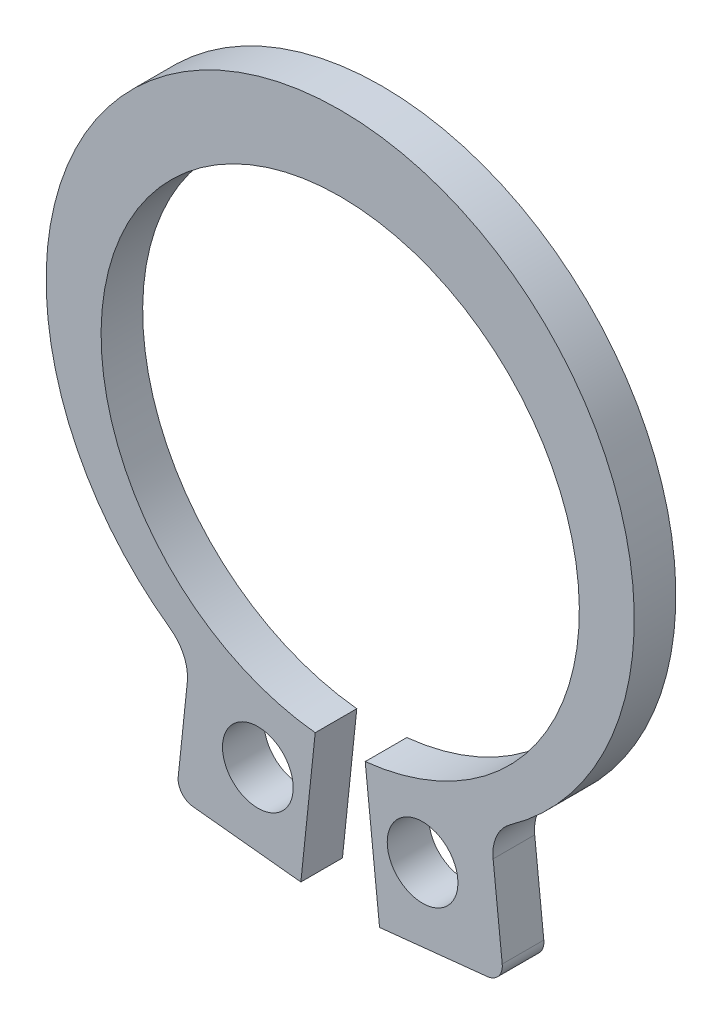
ISO-10303-21;
HEADER;
FILE_DESCRIPTION(('STEP AP214'),'2;1');
FILE_NAME('part.step','',(''),(''),'','','');
FILE_SCHEMA(('AUTOMOTIVE_DESIGN { 1 0 10303 214 1 1 1 1 }'));
ENDSEC;
DATA;
#1=APPLICATION_CONTEXT('core data for automotive mechanical design processes');
#2=APPLICATION_PROTOCOL_DEFINITION('international standard','automotive_design',2000,#1);
#3=PRODUCT_CONTEXT('',#1,'mechanical');
#4=PRODUCT('Part','Part','',(#3));
#5=PRODUCT_RELATED_PRODUCT_CATEGORY('part','',(#4));
#6=PRODUCT_DEFINITION_FORMATION('','',#4);
#7=PRODUCT_DEFINITION_CONTEXT('part definition',#1,'design');
#8=PRODUCT_DEFINITION('design','',#6,#7);
#9=PRODUCT_DEFINITION_SHAPE('','',#8);
#10=(LENGTH_UNIT() NAMED_UNIT(*) SI_UNIT(.MILLI.,.METRE.));
#11=(NAMED_UNIT(*) PLANE_ANGLE_UNIT() SI_UNIT($,.RADIAN.));
#12=(NAMED_UNIT(*) SI_UNIT($,.STERADIAN.) SOLID_ANGLE_UNIT());
#13=UNCERTAINTY_MEASURE_WITH_UNIT(LENGTH_MEASURE(1.E-05),#10,'distance_accuracy_value','');
#14=(GEOMETRIC_REPRESENTATION_CONTEXT(3) GLOBAL_UNCERTAINTY_ASSIGNED_CONTEXT((#13)) GLOBAL_UNIT_ASSIGNED_CONTEXT((#10,
#11,#12)) REPRESENTATION_CONTEXT('',''));
#15=CARTESIAN_POINT('',(0.,0.,0.));
#16=DIRECTION('',(0.,0.,1.));
#17=DIRECTION('',(1.,0.,0.));
#18=AXIS2_PLACEMENT_3D('',#15,#16,#17);
#19=CARTESIAN_POINT('',(0.,0.,1.));
#20=DIRECTION('',(0.,0.,1.));
#21=DIRECTION('',(1.,0.,0.));
#22=AXIS2_PLACEMENT_3D('',#19,#20,#21);
#23=PLANE('',#22);
#24=CARTESIAN_POINT('',(1.98041329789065,-7.13007455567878,1.));
#25=DIRECTION('',(0.,0.,1.));
#26=DIRECTION('',(-1.,0.,0.));
#27=AXIS2_PLACEMENT_3D('',#24,#25,#26);
#28=CIRCLE('',#27,0.85);
#29=CARTESIAN_POINT('',(1.13041329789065,-7.13007455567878,1.));
#30=VERTEX_POINT('',#29);
#31=EDGE_CURVE('E137',#30,#30,#28,.T.);
#32=ORIENTED_EDGE('',*,*,#31,.F.);
#33=EDGE_LOOP('',(#32));
#34=FACE_BOUND('',#33,.T.);
#35=CARTESIAN_POINT('',(0.,0.,1.));
#36=DIRECTION('',(0.,0.,-1.));
#37=DIRECTION('',(1.,0.,0.));
#38=AXIS2_PLACEMENT_3D('',#35,#36,#37);
#39=CIRCLE('',#38,5.75);
#40=CARTESIAN_POINT('',(-0.601038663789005,-5.71850089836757,1.));
#41=VERTEX_POINT('',#40);
#42=CARTESIAN_POINT('',(0.601038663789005,-5.71850089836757,1.));
#43=VERTEX_POINT('',#42);
#44=EDGE_CURVE('E163',#41,#43,#39,.T.);
#45=ORIENTED_EDGE('',*,*,#44,.T.);
#46=DIRECTION('',(0.104528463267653,-0.994521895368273,0.));
#47=VECTOR('',#46,1.);
#48=CARTESIAN_POINT('',(0.94598259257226,-9.00042315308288,1.));
#49=LINE('',#48,#47);
#50=CARTESIAN_POINT('',(0.94598259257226,-9.00042315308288,1.));
#51=VERTEX_POINT('',#50);
#52=EDGE_CURVE('E132',#43,#51,#49,.T.);
#53=ORIENTED_EDGE('',*,*,#52,.T.);
#54=DIRECTION('',(0.994521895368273,0.104528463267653,0.));
#55=VECTOR('',#54,1.);
#56=CARTESIAN_POINT('',(3.53965366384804,-8.72781733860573,1.));
#57=LINE('',#56,#55);
#58=CARTESIAN_POINT('',(3.53965366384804,-8.72781733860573,1.));
#59=VERTEX_POINT('',#58);
#60=EDGE_CURVE('E166',#51,#59,#57,.T.);
#61=ORIENTED_EDGE('',*,*,#60,.T.);
#62=CARTESIAN_POINT('',(3.49784227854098,-8.33000858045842,1.));
#63=DIRECTION('',(0.,0.,1.));
#64=DIRECTION('',(-1.,0.,0.));
#65=AXIS2_PLACEMENT_3D('',#62,#63,#64);
#66=CIRCLE('',#65,0.400000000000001);
#67=CARTESIAN_POINT('',(3.89565103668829,-8.28819719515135,1.));
#68=VERTEX_POINT('',#67);
#69=EDGE_CURVE('E168',#59,#68,#66,.T.);
#70=ORIENTED_EDGE('',*,*,#69,.T.);
#71=DIRECTION('',(-0.104528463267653,0.994521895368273,0.));
#72=VECTOR('',#71,1.);
#73=CARTESIAN_POINT('',(3.6769137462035,-6.20705089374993,1.));
#74=LINE('',#73,#72);
#75=CARTESIAN_POINT('',(3.6769137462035,-6.20705089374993,1.));
#76=VERTEX_POINT('',#75);
#77=EDGE_CURVE('E170',#68,#76,#74,.T.);
#78=ORIENTED_EDGE('',*,*,#77,.T.);
#79=CARTESIAN_POINT('',(4.67143564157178,-6.10252243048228,1.));
#80=DIRECTION('',(0.,0.,-1.));
#81=DIRECTION('',(1.,0.,0.));
#82=AXIS2_PLACEMENT_3D('',#79,#80,#81);
#83=CIRCLE('',#82,1.);
#84=CARTESIAN_POINT('',(4.09263736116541,-5.2870516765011,1.));
#85=VERTEX_POINT('',#84);
#86=EDGE_CURVE('E172',#76,#85,#83,.T.);
#87=ORIENTED_EDGE('',*,*,#86,.T.);
#88=CARTESIAN_POINT('',(0.,0.479078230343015,1.));
#89=DIRECTION('',(0.,0.,1.));
#90=DIRECTION('',(-1.,0.,0.));
#91=AXIS2_PLACEMENT_3D('',#88,#89,#90);
#92=CIRCLE('',#91,7.07092176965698);
#93=CARTESIAN_POINT('',(-4.0926373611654,-5.2870516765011,1.));
#94=VERTEX_POINT('',#93);
#95=EDGE_CURVE('E174',#85,#94,#92,.T.);
#96=ORIENTED_EDGE('',*,*,#95,.T.);
#97=CARTESIAN_POINT('',(-4.67143564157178,-6.10252243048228,1.));
#98=DIRECTION('',(0.,0.,-1.));
#99=DIRECTION('',(1.,0.,0.));
#100=AXIS2_PLACEMENT_3D('',#97,#98,#99);
#101=CIRCLE('',#100,1.);
#102=CARTESIAN_POINT('',(-3.6769137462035,-6.20705089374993,1.));
#103=VERTEX_POINT('',#102);
#104=EDGE_CURVE('E176',#94,#103,#101,.T.);
#105=ORIENTED_EDGE('',*,*,#104,.T.);
#106=DIRECTION('',(-0.104528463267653,-0.994521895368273,0.));
#107=VECTOR('',#106,1.);
#108=CARTESIAN_POINT('',(-3.89565103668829,-8.28819719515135,1.));
#109=LINE('',#108,#107);
#110=CARTESIAN_POINT('',(-3.89565103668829,-8.28819719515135,1.));
#111=VERTEX_POINT('',#110);
#112=EDGE_CURVE('E178',#103,#111,#109,.T.);
#113=ORIENTED_EDGE('',*,*,#112,.T.);
#114=CARTESIAN_POINT('',(-3.49784227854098,-8.33000858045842,1.));
#115=DIRECTION('',(0.,0.,1.));
#116=DIRECTION('',(-1.,0.,0.));
#117=AXIS2_PLACEMENT_3D('',#114,#115,#116);
#118=CIRCLE('',#117,0.400000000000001);
#119=CARTESIAN_POINT('',(-3.53965366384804,-8.72781733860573,1.));
#120=VERTEX_POINT('',#119);
#121=EDGE_CURVE('E180',#111,#120,#118,.T.);
#122=ORIENTED_EDGE('',*,*,#121,.T.);
#123=DIRECTION('',(0.994521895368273,-0.104528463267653,0.));
#124=VECTOR('',#123,1.);
#125=CARTESIAN_POINT('',(-0.94598259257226,-9.00042315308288,1.));
#126=LINE('',#125,#124);
#127=CARTESIAN_POINT('',(-0.94598259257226,-9.00042315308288,1.));
#128=VERTEX_POINT('',#127);
#129=EDGE_CURVE('E49',#120,#128,#126,.T.);
#130=ORIENTED_EDGE('',*,*,#129,.T.);
#131=DIRECTION('',(0.104528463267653,0.994521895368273,0.));
#132=VECTOR('',#131,1.);
#133=CARTESIAN_POINT('',(-0.601038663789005,-5.71850089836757,1.));
#134=LINE('',#133,#132);
#135=EDGE_CURVE('E44',#128,#41,#134,.T.);
#136=ORIENTED_EDGE('',*,*,#135,.T.);
#137=EDGE_LOOP('',(#45,#53,#61,#70,#78,#87,#96,#105,#113,#122,#130,#136));
#138=FACE_BOUND('',#137,.T.);
#139=CARTESIAN_POINT('',(-1.98041329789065,-7.13007455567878,1.));
#140=DIRECTION('',(0.,0.,1.));
#141=DIRECTION('',(-1.,0.,0.));
#142=AXIS2_PLACEMENT_3D('',#139,#140,#141);
#143=CIRCLE('',#142,0.85);
#144=CARTESIAN_POINT('',(-2.83041329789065,-7.13007455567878,1.));
#145=VERTEX_POINT('',#144);
#146=EDGE_CURVE('E286',#145,#145,#143,.T.);
#147=ORIENTED_EDGE('',*,*,#146,.F.);
#148=EDGE_LOOP('',(#147));
#149=FACE_BOUND('',#148,.T.);
#150=ADVANCED_FACE('F29',(#34,#138,#149),#23,.T.);
#151=CARTESIAN_POINT('',(0.,0.,0.));
#152=DIRECTION('',(0.,0.,1.));
#153=DIRECTION('',(1.,0.,0.));
#154=AXIS2_PLACEMENT_3D('',#151,#152,#153);
#155=PLANE('',#154);
#156=CARTESIAN_POINT('',(1.98041329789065,-7.13007455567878,0.));
#157=DIRECTION('',(0.,0.,1.));
#158=DIRECTION('',(-1.,0.,0.));
#159=AXIS2_PLACEMENT_3D('',#156,#157,#158);
#160=CIRCLE('',#159,0.85);
#161=CARTESIAN_POINT('',(1.13041329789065,-7.13007455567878,0.));
#162=VERTEX_POINT('',#161);
#163=EDGE_CURVE('E140',#162,#162,#160,.T.);
#164=ORIENTED_EDGE('',*,*,#163,.T.);
#165=EDGE_LOOP('',(#164));
#166=FACE_BOUND('',#165,.T.);
#167=CARTESIAN_POINT('',(0.,0.,0.));
#168=DIRECTION('',(0.,0.,-1.));
#169=DIRECTION('',(1.,0.,0.));
#170=AXIS2_PLACEMENT_3D('',#167,#168,#169);
#171=CIRCLE('',#170,5.75);
#172=CARTESIAN_POINT('',(-0.601038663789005,-5.71850089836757,0.));
#173=VERTEX_POINT('',#172);
#174=CARTESIAN_POINT('',(0.601038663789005,-5.71850089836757,0.));
#175=VERTEX_POINT('',#174);
#176=EDGE_CURVE('E123',#173,#175,#171,.T.);
#177=ORIENTED_EDGE('',*,*,#176,.F.);
#178=DIRECTION('',(0.104528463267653,0.994521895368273,0.));
#179=VECTOR('',#178,1.);
#180=CARTESIAN_POINT('',(-0.601038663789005,-5.71850089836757,0.));
#181=LINE('',#180,#179);
#182=CARTESIAN_POINT('',(-0.94598259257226,-9.00042315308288,0.));
#183=VERTEX_POINT('',#182);
#184=EDGE_CURVE('E161',#183,#173,#181,.T.);
#185=ORIENTED_EDGE('',*,*,#184,.F.);
#186=DIRECTION('',(0.994521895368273,-0.104528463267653,0.));
#187=VECTOR('',#186,1.);
#188=CARTESIAN_POINT('',(-0.94598259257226,-9.00042315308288,0.));
#189=LINE('',#188,#187);
#190=CARTESIAN_POINT('',(-3.53965366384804,-8.72781733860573,0.));
#191=VERTEX_POINT('',#190);
#192=EDGE_CURVE('E159',#191,#183,#189,.T.);
#193=ORIENTED_EDGE('',*,*,#192,.F.);
#194=CARTESIAN_POINT('',(-3.49784227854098,-8.33000858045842,0.));
#195=DIRECTION('',(0.,0.,1.));
#196=DIRECTION('',(-1.,0.,0.));
#197=AXIS2_PLACEMENT_3D('',#194,#195,#196);
#198=CIRCLE('',#197,0.400000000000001);
#199=CARTESIAN_POINT('',(-3.89565103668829,-8.28819719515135,0.));
#200=VERTEX_POINT('',#199);
#201=EDGE_CURVE('E157',#200,#191,#198,.T.);
#202=ORIENTED_EDGE('',*,*,#201,.F.);
#203=DIRECTION('',(-0.104528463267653,-0.994521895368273,0.));
#204=VECTOR('',#203,1.);
#205=CARTESIAN_POINT('',(-3.89565103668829,-8.28819719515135,0.));
#206=LINE('',#205,#204);
#207=CARTESIAN_POINT('',(-3.6769137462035,-6.20705089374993,0.));
#208=VERTEX_POINT('',#207);
#209=EDGE_CURVE('E155',#208,#200,#206,.T.);
#210=ORIENTED_EDGE('',*,*,#209,.F.);
#211=CARTESIAN_POINT('',(-4.67143564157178,-6.10252243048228,0.));
#212=DIRECTION('',(0.,0.,-1.));
#213=DIRECTION('',(1.,0.,0.));
#214=AXIS2_PLACEMENT_3D('',#211,#212,#213);
#215=CIRCLE('',#214,1.);
#216=CARTESIAN_POINT('',(-4.0926373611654,-5.2870516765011,0.));
#217=VERTEX_POINT('',#216);
#218=EDGE_CURVE('E153',#217,#208,#215,.T.);
#219=ORIENTED_EDGE('',*,*,#218,.F.);
#220=CARTESIAN_POINT('',(0.,0.479078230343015,0.));
#221=DIRECTION('',(0.,0.,1.));
#222=DIRECTION('',(-1.,0.,0.));
#223=AXIS2_PLACEMENT_3D('',#220,#221,#222);
#224=CIRCLE('',#223,7.07092176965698);
#225=CARTESIAN_POINT('',(4.09263736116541,-5.2870516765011,0.));
#226=VERTEX_POINT('',#225);
#227=EDGE_CURVE('E151',#226,#217,#224,.T.);
#228=ORIENTED_EDGE('',*,*,#227,.F.);
#229=CARTESIAN_POINT('',(4.67143564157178,-6.10252243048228,0.));
#230=DIRECTION('',(0.,0.,-1.));
#231=DIRECTION('',(1.,0.,0.));
#232=AXIS2_PLACEMENT_3D('',#229,#230,#231);
#233=CIRCLE('',#232,1.);
#234=CARTESIAN_POINT('',(3.6769137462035,-6.20705089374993,0.));
#235=VERTEX_POINT('',#234);
#236=EDGE_CURVE('E149',#235,#226,#233,.T.);
#237=ORIENTED_EDGE('',*,*,#236,.F.);
#238=DIRECTION('',(-0.104528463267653,0.994521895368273,0.));
#239=VECTOR('',#238,1.);
#240=CARTESIAN_POINT('',(3.6769137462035,-6.20705089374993,0.));
#241=LINE('',#240,#239);
#242=CARTESIAN_POINT('',(3.89565103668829,-8.28819719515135,0.));
#243=VERTEX_POINT('',#242);
#244=EDGE_CURVE('E147',#243,#235,#241,.T.);
#245=ORIENTED_EDGE('',*,*,#244,.F.);
#246=CARTESIAN_POINT('',(3.49784227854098,-8.33000858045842,0.));
#247=DIRECTION('',(0.,0.,1.));
#248=DIRECTION('',(-1.,0.,0.));
#249=AXIS2_PLACEMENT_3D('',#246,#247,#248);
#250=CIRCLE('',#249,0.400000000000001);
#251=CARTESIAN_POINT('',(3.53965366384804,-8.72781733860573,0.));
#252=VERTEX_POINT('',#251);
#253=EDGE_CURVE('E145',#252,#243,#250,.T.);
#254=ORIENTED_EDGE('',*,*,#253,.F.);
#255=DIRECTION('',(0.994521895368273,0.104528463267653,0.));
#256=VECTOR('',#255,1.);
#257=CARTESIAN_POINT('',(3.53965366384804,-8.72781733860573,0.));
#258=LINE('',#257,#256);
#259=CARTESIAN_POINT('',(0.94598259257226,-9.00042315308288,0.));
#260=VERTEX_POINT('',#259);
#261=EDGE_CURVE('E125',#260,#252,#258,.T.);
#262=ORIENTED_EDGE('',*,*,#261,.F.);
#263=DIRECTION('',(0.104528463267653,-0.994521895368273,0.));
#264=VECTOR('',#263,1.);
#265=CARTESIAN_POINT('',(0.94598259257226,-9.00042315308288,0.));
#266=LINE('',#265,#264);
#267=EDGE_CURVE('E118',#175,#260,#266,.T.);
#268=ORIENTED_EDGE('',*,*,#267,.F.);
#269=EDGE_LOOP('',(#177,#185,#193,#202,#210,#219,#228,#237,#245,#254,#262,#268));
#270=FACE_BOUND('',#269,.T.);
#271=CARTESIAN_POINT('',(-1.98041329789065,-7.13007455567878,0.));
#272=DIRECTION('',(0.,0.,1.));
#273=DIRECTION('',(-1.,0.,0.));
#274=AXIS2_PLACEMENT_3D('',#271,#272,#273);
#275=CIRCLE('',#274,0.85);
#276=CARTESIAN_POINT('',(-2.83041329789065,-7.13007455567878,0.));
#277=VERTEX_POINT('',#276);
#278=EDGE_CURVE('E283',#277,#277,#275,.T.);
#279=ORIENTED_EDGE('',*,*,#278,.T.);
#280=EDGE_LOOP('',(#279));
#281=FACE_BOUND('',#280,.T.);
#282=ADVANCED_FACE('F119',(#166,#270,#281),#155,.F.);
#283=CARTESIAN_POINT('',(0.,0.,1.));
#284=DIRECTION('',(0.,0.,-1.));
#285=DIRECTION('',(-1.,0.,0.));
#286=AXIS2_PLACEMENT_3D('',#283,#284,#285);
#287=CYLINDRICAL_SURFACE('',#286,5.75);
#288=ORIENTED_EDGE('',*,*,#176,.T.);
#289=DIRECTION('',(0.,0.,-1.));
#290=VECTOR('',#289,1.);
#291=CARTESIAN_POINT('',(0.601038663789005,-5.71850089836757,1.));
#292=LINE('',#291,#290);
#293=EDGE_CURVE('E11',#43,#175,#292,.T.);
#294=ORIENTED_EDGE('',*,*,#293,.F.);
#295=ORIENTED_EDGE('',*,*,#44,.F.);
#296=DIRECTION('',(0.,0.,-1.));
#297=VECTOR('',#296,1.);
#298=CARTESIAN_POINT('',(-0.601038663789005,-5.71850089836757,1.));
#299=LINE('',#298,#297);
#300=EDGE_CURVE('E136',#41,#173,#299,.T.);
#301=ORIENTED_EDGE('',*,*,#300,.T.);
#302=EDGE_LOOP('',(#288,#294,#295,#301));
#303=FACE_BOUND('',#302,.T.);
#304=ADVANCED_FACE('F31',(#303),#287,.F.);
#305=CARTESIAN_POINT('',(0.94598259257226,-9.00042315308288,1.));
#306=DIRECTION('',(0.994521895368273,0.104528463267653,0.));
#307=DIRECTION('',(-0.104528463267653,0.994521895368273,0.));
#308=AXIS2_PLACEMENT_3D('',#305,#306,#307);
#309=PLANE('',#308);
#310=ORIENTED_EDGE('',*,*,#267,.T.);
#311=DIRECTION('',(0.,0.,-1.));
#312=VECTOR('',#311,1.);
#313=CARTESIAN_POINT('',(0.94598259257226,-9.00042315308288,1.));
#314=LINE('',#313,#312);
#315=EDGE_CURVE('E37',#51,#260,#314,.T.);
#316=ORIENTED_EDGE('',*,*,#315,.F.);
#317=ORIENTED_EDGE('',*,*,#52,.F.);
#318=ORIENTED_EDGE('',*,*,#293,.T.);
#319=EDGE_LOOP('',(#310,#316,#317,#318));
#320=FACE_BOUND('',#319,.T.);
#321=ADVANCED_FACE('F131',(#320),#309,.F.);
#322=CARTESIAN_POINT('',(3.53965366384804,-8.72781733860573,1.));
#323=DIRECTION('',(-0.104528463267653,0.994521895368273,0.));
#324=DIRECTION('',(-0.994521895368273,-0.104528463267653,0.));
#325=AXIS2_PLACEMENT_3D('',#322,#323,#324);
#326=PLANE('',#325);
#327=ORIENTED_EDGE('',*,*,#261,.T.);
#328=DIRECTION('',(0.,0.,-1.));
#329=VECTOR('',#328,1.);
#330=CARTESIAN_POINT('',(3.53965366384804,-8.72781733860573,1.));
#331=LINE('',#330,#329);
#332=EDGE_CURVE('E209',#59,#252,#331,.T.);
#333=ORIENTED_EDGE('',*,*,#332,.F.);
#334=ORIENTED_EDGE('',*,*,#60,.F.);
#335=ORIENTED_EDGE('',*,*,#315,.T.);
#336=EDGE_LOOP('',(#327,#333,#334,#335));
#337=FACE_BOUND('',#336,.T.);
#338=ADVANCED_FACE('F213',(#337),#326,.F.);
#339=CARTESIAN_POINT('',(3.49784227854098,-8.33000858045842,1.));
#340=DIRECTION('',(0.,0.,-1.));
#341=DIRECTION('',(-1.,0.,0.));
#342=AXIS2_PLACEMENT_3D('',#339,#340,#341);
#343=CYLINDRICAL_SURFACE('',#342,0.400000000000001);
#344=ORIENTED_EDGE('',*,*,#253,.T.);
#345=DIRECTION('',(0.,0.,-1.));
#346=VECTOR('',#345,1.);
#347=CARTESIAN_POINT('',(3.89565103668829,-8.28819719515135,1.));
#348=LINE('',#347,#346);
#349=EDGE_CURVE('E206',#68,#243,#348,.T.);
#350=ORIENTED_EDGE('',*,*,#349,.F.);
#351=ORIENTED_EDGE('',*,*,#69,.F.);
#352=ORIENTED_EDGE('',*,*,#332,.T.);
#353=EDGE_LOOP('',(#344,#350,#351,#352));
#354=FACE_BOUND('',#353,.T.);
#355=ADVANCED_FACE('F221',(#354),#343,.T.);
#356=CARTESIAN_POINT('',(3.6769137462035,-6.20705089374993,1.));
#357=DIRECTION('',(-0.994521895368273,-0.104528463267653,0.));
#358=DIRECTION('',(0.104528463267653,-0.994521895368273,0.));
#359=AXIS2_PLACEMENT_3D('',#356,#357,#358);
#360=PLANE('',#359);
#361=ORIENTED_EDGE('',*,*,#244,.T.);
#362=DIRECTION('',(0.,0.,-1.));
#363=VECTOR('',#362,1.);
#364=CARTESIAN_POINT('',(3.6769137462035,-6.20705089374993,1.));
#365=LINE('',#364,#363);
#366=EDGE_CURVE('E203',#76,#235,#365,.T.);
#367=ORIENTED_EDGE('',*,*,#366,.F.);
#368=ORIENTED_EDGE('',*,*,#77,.F.);
#369=ORIENTED_EDGE('',*,*,#349,.T.);
#370=EDGE_LOOP('',(#361,#367,#368,#369));
#371=FACE_BOUND('',#370,.T.);
#372=ADVANCED_FACE('F224',(#371),#360,.F.);
#373=CARTESIAN_POINT('',(4.67143564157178,-6.10252243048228,1.));
#374=DIRECTION('',(0.,0.,-1.));
#375=DIRECTION('',(-1.,0.,0.));
#376=AXIS2_PLACEMENT_3D('',#373,#374,#375);
#377=CYLINDRICAL_SURFACE('',#376,1.);
#378=ORIENTED_EDGE('',*,*,#236,.T.);
#379=DIRECTION('',(0.,0.,-1.));
#380=VECTOR('',#379,1.);
#381=CARTESIAN_POINT('',(4.09263736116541,-5.2870516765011,1.));
#382=LINE('',#381,#380);
#383=EDGE_CURVE('E200',#85,#226,#382,.T.);
#384=ORIENTED_EDGE('',*,*,#383,.F.);
#385=ORIENTED_EDGE('',*,*,#86,.F.);
#386=ORIENTED_EDGE('',*,*,#366,.T.);
#387=EDGE_LOOP('',(#378,#384,#385,#386));
#388=FACE_BOUND('',#387,.T.);
#389=ADVANCED_FACE('F229',(#388),#377,.F.);
#390=CARTESIAN_POINT('',(0.,0.479078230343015,1.));
#391=DIRECTION('',(0.,0.,-1.));
#392=DIRECTION('',(-1.,0.,0.));
#393=AXIS2_PLACEMENT_3D('',#390,#391,#392);
#394=CYLINDRICAL_SURFACE('',#393,7.07092176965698);
#395=ORIENTED_EDGE('',*,*,#227,.T.);
#396=DIRECTION('',(0.,0.,-1.));
#397=VECTOR('',#396,1.);
#398=CARTESIAN_POINT('',(-4.0926373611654,-5.2870516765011,1.));
#399=LINE('',#398,#397);
#400=EDGE_CURVE('E197',#94,#217,#399,.T.);
#401=ORIENTED_EDGE('',*,*,#400,.F.);
#402=ORIENTED_EDGE('',*,*,#95,.F.);
#403=ORIENTED_EDGE('',*,*,#383,.T.);
#404=EDGE_LOOP('',(#395,#401,#402,#403));
#405=FACE_BOUND('',#404,.T.);
#406=ADVANCED_FACE('F235',(#405),#394,.T.);
#407=CARTESIAN_POINT('',(-4.67143564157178,-6.10252243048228,1.));
#408=DIRECTION('',(0.,0.,-1.));
#409=DIRECTION('',(-1.,0.,0.));
#410=AXIS2_PLACEMENT_3D('',#407,#408,#409);
#411=CYLINDRICAL_SURFACE('',#410,1.);
#412=ORIENTED_EDGE('',*,*,#218,.T.);
#413=DIRECTION('',(0.,0.,-1.));
#414=VECTOR('',#413,1.);
#415=CARTESIAN_POINT('',(-3.6769137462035,-6.20705089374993,1.));
#416=LINE('',#415,#414);
#417=EDGE_CURVE('E194',#103,#208,#416,.T.);
#418=ORIENTED_EDGE('',*,*,#417,.F.);
#419=ORIENTED_EDGE('',*,*,#104,.F.);
#420=ORIENTED_EDGE('',*,*,#400,.T.);
#421=EDGE_LOOP('',(#412,#418,#419,#420));
#422=FACE_BOUND('',#421,.T.);
#423=ADVANCED_FACE('F239',(#422),#411,.F.);
#424=CARTESIAN_POINT('',(-3.89565103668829,-8.28819719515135,1.));
#425=DIRECTION('',(0.994521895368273,-0.104528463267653,0.));
#426=DIRECTION('',(0.104528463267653,0.994521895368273,0.));
#427=AXIS2_PLACEMENT_3D('',#424,#425,#426);
#428=PLANE('',#427);
#429=ORIENTED_EDGE('',*,*,#209,.T.);
#430=DIRECTION('',(0.,0.,-1.));
#431=VECTOR('',#430,1.);
#432=CARTESIAN_POINT('',(-3.89565103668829,-8.28819719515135,1.));
#433=LINE('',#432,#431);
#434=EDGE_CURVE('E191',#111,#200,#433,.T.);
#435=ORIENTED_EDGE('',*,*,#434,.F.);
#436=ORIENTED_EDGE('',*,*,#112,.F.);
#437=ORIENTED_EDGE('',*,*,#417,.T.);
#438=EDGE_LOOP('',(#429,#435,#436,#437));
#439=FACE_BOUND('',#438,.T.);
#440=ADVANCED_FACE('F244',(#439),#428,.F.);
#441=CARTESIAN_POINT('',(-3.49784227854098,-8.33000858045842,1.));
#442=DIRECTION('',(0.,0.,-1.));
#443=DIRECTION('',(-1.,0.,0.));
#444=AXIS2_PLACEMENT_3D('',#441,#442,#443);
#445=CYLINDRICAL_SURFACE('',#444,0.400000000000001);
#446=ORIENTED_EDGE('',*,*,#201,.T.);
#447=DIRECTION('',(0.,0.,-1.));
#448=VECTOR('',#447,1.);
#449=CARTESIAN_POINT('',(-3.53965366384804,-8.72781733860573,1.));
#450=LINE('',#449,#448);
#451=EDGE_CURVE('E188',#120,#191,#450,.T.);
#452=ORIENTED_EDGE('',*,*,#451,.F.);
#453=ORIENTED_EDGE('',*,*,#121,.F.);
#454=ORIENTED_EDGE('',*,*,#434,.T.);
#455=EDGE_LOOP('',(#446,#452,#453,#454));
#456=FACE_BOUND('',#455,.T.);
#457=ADVANCED_FACE('F248',(#456),#445,.T.);
#458=CARTESIAN_POINT('',(-0.94598259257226,-9.00042315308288,1.));
#459=DIRECTION('',(0.104528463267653,0.994521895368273,0.));
#460=DIRECTION('',(-0.994521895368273,0.104528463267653,0.));
#461=AXIS2_PLACEMENT_3D('',#458,#459,#460);
#462=PLANE('',#461);
#463=ORIENTED_EDGE('',*,*,#192,.T.);
#464=DIRECTION('',(0.,0.,-1.));
#465=VECTOR('',#464,1.);
#466=CARTESIAN_POINT('',(-0.94598259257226,-9.00042315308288,1.));
#467=LINE('',#466,#465);
#468=EDGE_CURVE('E185',#128,#183,#467,.T.);
#469=ORIENTED_EDGE('',*,*,#468,.F.);
#470=ORIENTED_EDGE('',*,*,#129,.F.);
#471=ORIENTED_EDGE('',*,*,#451,.T.);
#472=EDGE_LOOP('',(#463,#469,#470,#471));
#473=FACE_BOUND('',#472,.T.);
#474=ADVANCED_FACE('F252',(#473),#462,.F.);
#475=CARTESIAN_POINT('',(-0.601038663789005,-5.71850089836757,1.));
#476=DIRECTION('',(-0.994521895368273,0.104528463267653,0.));
#477=DIRECTION('',(-0.104528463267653,-0.994521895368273,0.));
#478=AXIS2_PLACEMENT_3D('',#475,#476,#477);
#479=PLANE('',#478);
#480=ORIENTED_EDGE('',*,*,#184,.T.);
#481=ORIENTED_EDGE('',*,*,#300,.F.);
#482=ORIENTED_EDGE('',*,*,#135,.F.);
#483=ORIENTED_EDGE('',*,*,#468,.T.);
#484=EDGE_LOOP('',(#480,#481,#482,#483));
#485=FACE_BOUND('',#484,.T.);
#486=ADVANCED_FACE('F254',(#485),#479,.F.);
#487=CARTESIAN_POINT('',(1.98041329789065,-7.13007455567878,1.));
#488=DIRECTION('',(0.,0.,-1.));
#489=DIRECTION('',(-1.,0.,0.));
#490=AXIS2_PLACEMENT_3D('',#487,#488,#489);
#491=CYLINDRICAL_SURFACE('',#490,0.85);
#492=ORIENTED_EDGE('',*,*,#163,.F.);
#493=EDGE_LOOP('',(#492));
#494=FACE_BOUND('',#493,.T.);
#495=ORIENTED_EDGE('',*,*,#31,.T.);
#496=EDGE_LOOP('',(#495));
#497=FACE_BOUND('',#496,.T.);
#498=ADVANCED_FACE('F256',(#494,#497),#491,.F.);
#499=CARTESIAN_POINT('',(-1.98041329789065,-7.13007455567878,1.));
#500=DIRECTION('',(0.,0.,-1.));
#501=DIRECTION('',(-1.,0.,0.));
#502=AXIS2_PLACEMENT_3D('',#499,#500,#501);
#503=CYLINDRICAL_SURFACE('',#502,0.85);
#504=ORIENTED_EDGE('',*,*,#278,.F.);
#505=EDGE_LOOP('',(#504));
#506=FACE_BOUND('',#505,.T.);
#507=ORIENTED_EDGE('',*,*,#146,.T.);
#508=EDGE_LOOP('',(#507));
#509=FACE_BOUND('',#508,.T.);
#510=ADVANCED_FACE('F262',(#506,#509),#503,.F.);
#511=CLOSED_SHELL('',(#150,#282,#304,#321,#338,#355,#372,#389,#406,#423,#440,#457,#474,#486,
#498,#510));
#512=MANIFOLD_SOLID_BREP('B2',#511);
#513=ADVANCED_BREP_SHAPE_REPRESENTATION('',(#18,#512),#14);
#514=SHAPE_DEFINITION_REPRESENTATION(#9,#513);
ENDSEC;
END-ISO-10303-21;
